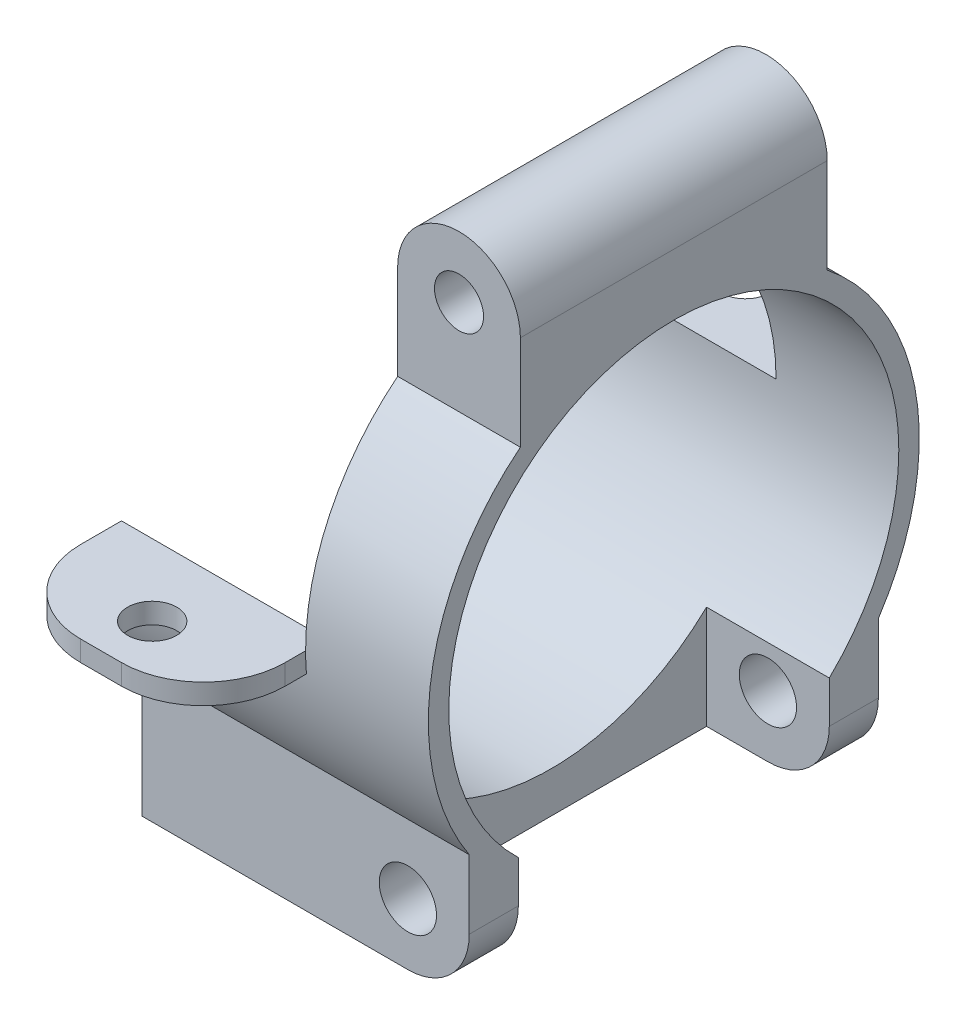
ISO-10303-21;
HEADER;
FILE_DESCRIPTION(('STEP AP214'),'2;1');
FILE_NAME('part.step','',(''),(''),'','','');
FILE_SCHEMA(('AUTOMOTIVE_DESIGN { 1 0 10303 214 1 1 1 1 }'));
ENDSEC;
DATA;
#1=APPLICATION_CONTEXT('core data for automotive mechanical design processes');
#2=APPLICATION_PROTOCOL_DEFINITION('international standard','automotive_design',2000,#1);
#3=PRODUCT_CONTEXT('',#1,'mechanical');
#4=PRODUCT('Part','Part','',(#3));
#5=PRODUCT_RELATED_PRODUCT_CATEGORY('part','',(#4));
#6=PRODUCT_DEFINITION_FORMATION('','',#4);
#7=PRODUCT_DEFINITION_CONTEXT('part definition',#1,'design');
#8=PRODUCT_DEFINITION('design','',#6,#7);
#9=PRODUCT_DEFINITION_SHAPE('','',#8);
#10=(LENGTH_UNIT() NAMED_UNIT(*) SI_UNIT(.MILLI.,.METRE.));
#11=(NAMED_UNIT(*) PLANE_ANGLE_UNIT() SI_UNIT($,.RADIAN.));
#12=(NAMED_UNIT(*) SI_UNIT($,.STERADIAN.) SOLID_ANGLE_UNIT());
#13=UNCERTAINTY_MEASURE_WITH_UNIT(LENGTH_MEASURE(1.E-05),#10,'distance_accuracy_value','');
#14=(GEOMETRIC_REPRESENTATION_CONTEXT(3) GLOBAL_UNCERTAINTY_ASSIGNED_CONTEXT((#13)) GLOBAL_UNIT_ASSIGNED_CONTEXT((#10,
#11,#12)) REPRESENTATION_CONTEXT('',''));
#15=CARTESIAN_POINT('',(0.,0.,0.));
#16=DIRECTION('',(0.,0.,1.));
#17=DIRECTION('',(1.,0.,0.));
#18=AXIS2_PLACEMENT_3D('',#15,#16,#17);
#19=CARTESIAN_POINT('',(0.,0.,9.525));
#20=DIRECTION('',(0.,0.,-1.));
#21=DIRECTION('',(-1.,0.,0.));
#22=AXIS2_PLACEMENT_3D('',#19,#20,#21);
#23=CYLINDRICAL_SURFACE('',#22,3.81);
#24=DIRECTION('',(0.,0.,1.));
#25=VECTOR('',#24,1.);
#26=CARTESIAN_POINT('',(0.,-3.81,-12.7));
#27=LINE('',#26,#25);
#28=CARTESIAN_POINT('',(0.,-3.81,9.652));
#29=VERTEX_POINT('',#28);
#30=CARTESIAN_POINT('',(0.,-3.81,12.7));
#31=VERTEX_POINT('',#30);
#32=EDGE_CURVE('E365',#29,#31,#27,.T.);
#33=ORIENTED_EDGE('',*,*,#32,.F.);
#34=CARTESIAN_POINT('',(0.,0.,9.652));
#35=DIRECTION('',(0.,0.,1.));
#36=DIRECTION('',(1.,0.,0.));
#37=AXIS2_PLACEMENT_3D('',#34,#35,#36);
#38=CIRCLE('',#37,3.81);
#39=CARTESIAN_POINT('',(3.81,0.,9.652));
#40=VERTEX_POINT('',#39);
#41=EDGE_CURVE('E325',#29,#40,#38,.T.);
#42=ORIENTED_EDGE('',*,*,#41,.T.);
#43=DIRECTION('',(0.,0.,-1.));
#44=VECTOR('',#43,1.);
#45=CARTESIAN_POINT('',(3.81,0.,9.525));
#46=LINE('',#45,#44);
#47=CARTESIAN_POINT('',(3.81,0.,12.7));
#48=VERTEX_POINT('',#47);
#49=EDGE_CURVE('E426',#48,#40,#46,.T.);
#50=ORIENTED_EDGE('',*,*,#49,.F.);
#51=CARTESIAN_POINT('',(0.,0.,12.7));
#52=DIRECTION('',(0.,0.,1.));
#53=DIRECTION('',(1.,0.,0.));
#54=AXIS2_PLACEMENT_3D('',#51,#52,#53);
#55=CIRCLE('',#54,3.81);
#56=EDGE_CURVE('E387',#31,#48,#55,.T.);
#57=ORIENTED_EDGE('',*,*,#56,.F.);
#58=EDGE_LOOP('',(#33,#42,#50,#57));
#59=FACE_BOUND('',#58,.T.);
#60=ADVANCED_FACE('F33',(#59),#23,.T.);
#61=CARTESIAN_POINT('',(0.,0.,-15.24));
#62=DIRECTION('',(0.,0.,1.));
#63=DIRECTION('',(1.,0.,0.));
#64=AXIS2_PLACEMENT_3D('',#61,#62,#63);
#65=CYLINDRICAL_SURFACE('',#64,1.778);
#66=CARTESIAN_POINT('',(0.,0.,9.652));
#67=DIRECTION('',(0.,0.,1.));
#68=DIRECTION('',(1.,0.,0.));
#69=AXIS2_PLACEMENT_3D('',#66,#67,#68);
#70=CIRCLE('',#69,1.778);
#71=CARTESIAN_POINT('',(1.778,0.,9.652));
#72=VERTEX_POINT('',#71);
#73=EDGE_CURVE('E321',#72,#72,#70,.F.);
#74=ORIENTED_EDGE('',*,*,#73,.T.);
#75=EDGE_LOOP('',(#74));
#76=FACE_BOUND('',#75,.T.);
#77=CARTESIAN_POINT('',(0.,0.,12.7));
#78=DIRECTION('',(0.,0.,1.));
#79=DIRECTION('',(1.,0.,0.));
#80=AXIS2_PLACEMENT_3D('',#77,#78,#79);
#81=CIRCLE('',#80,1.778);
#82=CARTESIAN_POINT('',(1.778,0.,12.7));
#83=VERTEX_POINT('',#82);
#84=EDGE_CURVE('E334',#83,#83,#81,.T.);
#85=ORIENTED_EDGE('',*,*,#84,.T.);
#86=EDGE_LOOP('',(#85));
#87=FACE_BOUND('',#86,.T.);
#88=ADVANCED_FACE('F543',(#76,#87),#65,.F.);
#89=CARTESIAN_POINT('',(3.81,0.,-9.652));
#90=VERTEX_POINT('',#89);
#91=CARTESIAN_POINT('',(3.81,0.,-12.7));
#92=VERTEX_POINT('',#91);
#93=EDGE_CURVE('E425',#90,#92,#46,.T.);
#94=ORIENTED_EDGE('',*,*,#93,.F.);
#95=CARTESIAN_POINT('',(0.,0.,-9.652));
#96=DIRECTION('',(0.,0.,-1.));
#97=DIRECTION('',(-1.,0.,0.));
#98=AXIS2_PLACEMENT_3D('',#95,#96,#97);
#99=CIRCLE('',#98,3.81);
#100=CARTESIAN_POINT('',(0.,-3.81,-9.652));
#101=VERTEX_POINT('',#100);
#102=EDGE_CURVE('E315',#90,#101,#99,.T.);
#103=ORIENTED_EDGE('',*,*,#102,.T.);
#104=CARTESIAN_POINT('',(0.,-3.81,-12.7));
#105=VERTEX_POINT('',#104);
#106=EDGE_CURVE('E366',#105,#101,#27,.T.);
#107=ORIENTED_EDGE('',*,*,#106,.F.);
#108=CARTESIAN_POINT('',(0.,0.,-12.7));
#109=DIRECTION('',(0.,0.,1.));
#110=DIRECTION('',(1.,0.,0.));
#111=AXIS2_PLACEMENT_3D('',#108,#109,#110);
#112=CIRCLE('',#111,3.81);
#113=EDGE_CURVE('E384',#105,#92,#112,.T.);
#114=ORIENTED_EDGE('',*,*,#113,.T.);
#115=EDGE_LOOP('',(#94,#103,#107,#114));
#116=FACE_BOUND('',#115,.T.);
#117=ADVANCED_FACE('F35',(#116),#23,.T.);
#118=CARTESIAN_POINT('',(-3.81,12.7,0.));
#119=DIRECTION('',(1.,0.,0.));
#120=DIRECTION('',(0.,0.,-1.));
#121=AXIS2_PLACEMENT_3D('',#118,#119,#120);
#122=CYLINDRICAL_SURFACE('',#121,15.24);
#123=CARTESIAN_POINT('',(-3.81,12.7,0.));
#124=DIRECTION('',(1.,0.,0.));
#125=DIRECTION('',(0.,1.,0.));
#126=AXIS2_PLACEMENT_3D('',#123,#124,#125);
#127=CIRCLE('',#126,15.24);
#128=CARTESIAN_POINT('',(-3.81,12.7,-15.24));
#129=VERTEX_POINT('',#128);
#130=CARTESIAN_POINT('',(-3.81,11.43,-15.1869911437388));
#131=VERTEX_POINT('',#130);
#132=EDGE_CURVE('E301',#129,#131,#127,.F.);
#133=ORIENTED_EDGE('',*,*,#132,.F.);
#134=CARTESIAN_POINT('',(-3.81,12.7,0.));
#135=DIRECTION('',(1.,0.,0.));
#136=DIRECTION('',(0.,0.,-1.));
#137=AXIS2_PLACEMENT_3D('',#134,#135,#136);
#138=CIRCLE('',#137,15.24);
#139=CARTESIAN_POINT('',(-3.81,24.5967211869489,-9.525));
#140=VERTEX_POINT('',#139);
#141=EDGE_CURVE('E398',#129,#140,#138,.T.);
#142=ORIENTED_EDGE('',*,*,#141,.T.);
#143=DIRECTION('',(1.,0.,0.));
#144=VECTOR('',#143,1.);
#145=CARTESIAN_POINT('',(-3.81,24.5967211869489,-9.525));
#146=LINE('',#145,#144);
#147=CARTESIAN_POINT('',(3.81,24.5967211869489,-9.525));
#148=VERTEX_POINT('',#147);
#149=EDGE_CURVE('E429',#148,#140,#146,.F.);
#150=ORIENTED_EDGE('',*,*,#149,.F.);
#151=CARTESIAN_POINT('',(3.81,12.7,0.));
#152=DIRECTION('',(1.,0.,0.));
#153=DIRECTION('',(0.,0.,-1.));
#154=AXIS2_PLACEMENT_3D('',#151,#152,#153);
#155=CIRCLE('',#154,15.24);
#156=CARTESIAN_POINT('',(3.81,4.27577303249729,-12.7));
#157=VERTEX_POINT('',#156);
#158=EDGE_CURVE('E393',#157,#148,#155,.T.);
#159=ORIENTED_EDGE('',*,*,#158,.F.);
#160=DIRECTION('',(1.,0.,0.));
#161=VECTOR('',#160,1.);
#162=CARTESIAN_POINT('',(-3.81,4.27577303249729,-12.7));
#163=LINE('',#162,#161);
#164=CARTESIAN_POINT('',(-16.51,4.27577303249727,-12.7));
#165=VERTEX_POINT('',#164);
#166=EDGE_CURVE('E42',#157,#165,#163,.F.);
#167=ORIENTED_EDGE('',*,*,#166,.T.);
#168=CARTESIAN_POINT('',(-16.51,12.7,0.));
#169=DIRECTION('',(-1.,0.,0.));
#170=DIRECTION('',(0.,-1.,0.));
#171=AXIS2_PLACEMENT_3D('',#168,#169,#170);
#172=CIRCLE('',#171,15.24);
#173=CARTESIAN_POINT('',(-16.51,11.43,-15.1869911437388));
#174=VERTEX_POINT('',#173);
#175=EDGE_CURVE('E344',#174,#165,#172,.T.);
#176=ORIENTED_EDGE('',*,*,#175,.F.);
#177=DIRECTION('',(1.,0.,0.));
#178=VECTOR('',#177,1.);
#179=CARTESIAN_POINT('',(-3.81,11.43,-15.1869911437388));
#180=LINE('',#179,#178);
#181=EDGE_CURVE('E292',#174,#131,#180,.T.);
#182=ORIENTED_EDGE('',*,*,#181,.T.);
#183=EDGE_LOOP('',(#133,#142,#150,#159,#167,#176,#182));
#184=FACE_BOUND('',#183,.T.);
#185=ADVANCED_FACE('F489',(#184),#122,.T.);
#186=CARTESIAN_POINT('',(3.81,0.,9.525));
#187=DIRECTION('',(-1.,0.,0.));
#188=DIRECTION('',(0.,0.,1.));
#189=AXIS2_PLACEMENT_3D('',#186,#187,#188);
#190=PLANE('',#189);
#191=ORIENTED_EDGE('',*,*,#49,.T.);
#192=DIRECTION('',(0.,-1.,0.));
#193=VECTOR('',#192,1.);
#194=CARTESIAN_POINT('',(3.81,-5.20623341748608,9.652));
#195=LINE('',#194,#193);
#196=CARTESIAN_POINT('',(3.81,2.6005051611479,9.652));
#197=VERTEX_POINT('',#196);
#198=EDGE_CURVE('E303',#197,#40,#195,.T.);
#199=ORIENTED_EDGE('',*,*,#198,.F.);
#200=CARTESIAN_POINT('',(3.81,12.7,0.));
#201=DIRECTION('',(1.,0.,0.));
#202=DIRECTION('',(0.,0.,-1.));
#203=AXIS2_PLACEMENT_3D('',#200,#201,#202);
#204=CIRCLE('',#203,13.97);
#205=CARTESIAN_POINT('',(3.81,2.60050516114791,-9.652));
#206=VERTEX_POINT('',#205);
#207=EDGE_CURVE('E381',#206,#197,#204,.T.);
#208=ORIENTED_EDGE('',*,*,#207,.F.);
#209=DIRECTION('',(0.,1.,0.));
#210=VECTOR('',#209,1.);
#211=CARTESIAN_POINT('',(3.81,-5.20623341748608,-9.652));
#212=LINE('',#211,#210);
#213=EDGE_CURVE('E307',#90,#206,#212,.T.);
#214=ORIENTED_EDGE('',*,*,#213,.F.);
#215=ORIENTED_EDGE('',*,*,#93,.T.);
#216=DIRECTION('',(0.,1.,0.));
#217=VECTOR('',#216,1.);
#218=CARTESIAN_POINT('',(3.81,0.,-12.7));
#219=LINE('',#218,#217);
#220=EDGE_CURVE('E390',#92,#157,#219,.T.);
#221=ORIENTED_EDGE('',*,*,#220,.T.);
#222=ORIENTED_EDGE('',*,*,#158,.T.);
#223=DIRECTION('',(0.,1.,0.));
#224=VECTOR('',#223,1.);
#225=CARTESIAN_POINT('',(3.81,0.,-9.525));
#226=LINE('',#225,#224);
#227=CARTESIAN_POINT('',(3.81,30.48,-9.525));
#228=VERTEX_POINT('',#227);
#229=EDGE_CURVE('E406',#148,#228,#226,.T.);
#230=ORIENTED_EDGE('',*,*,#229,.T.);
#231=DIRECTION('',(0.,0.,-1.));
#232=VECTOR('',#231,1.);
#233=CARTESIAN_POINT('',(3.81,30.48,9.525));
#234=LINE('',#233,#232);
#235=CARTESIAN_POINT('',(3.81,30.48,9.525));
#236=VERTEX_POINT('',#235);
#237=EDGE_CURVE('E422',#236,#228,#234,.T.);
#238=ORIENTED_EDGE('',*,*,#237,.F.);
#239=DIRECTION('',(0.,1.,0.));
#240=VECTOR('',#239,1.);
#241=CARTESIAN_POINT('',(3.81,0.,9.525));
#242=LINE('',#241,#240);
#243=CARTESIAN_POINT('',(3.81,24.596721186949,9.525));
#244=VERTEX_POINT('',#243);
#245=EDGE_CURVE('E407',#244,#236,#242,.T.);
#246=ORIENTED_EDGE('',*,*,#245,.F.);
#247=CARTESIAN_POINT('',(3.81,4.27577303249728,12.7));
#248=VERTEX_POINT('',#247);
#249=EDGE_CURVE('E401',#244,#248,#155,.T.);
#250=ORIENTED_EDGE('',*,*,#249,.T.);
#251=DIRECTION('',(0.,1.,0.));
#252=VECTOR('',#251,1.);
#253=CARTESIAN_POINT('',(3.81,0.,12.7));
#254=LINE('',#253,#252);
#255=EDGE_CURVE('E389',#48,#248,#254,.T.);
#256=ORIENTED_EDGE('',*,*,#255,.F.);
#257=EDGE_LOOP('',(#191,#199,#208,#214,#215,#221,#222,#230,#238,#246,#250,#256));
#258=FACE_BOUND('',#257,.T.);
#259=ADVANCED_FACE('F510',(#258),#190,.F.);
#260=CARTESIAN_POINT('',(0.,30.48,9.525));
#261=DIRECTION('',(0.,0.,-1.));
#262=DIRECTION('',(-1.,0.,0.));
#263=AXIS2_PLACEMENT_3D('',#260,#261,#262);
#264=CYLINDRICAL_SURFACE('',#263,3.81);
#265=CARTESIAN_POINT('',(0.,30.48,-9.525));
#266=DIRECTION('',(0.,0.,1.));
#267=DIRECTION('',(1.,0.,0.));
#268=AXIS2_PLACEMENT_3D('',#265,#266,#267);
#269=CIRCLE('',#268,3.81);
#270=CARTESIAN_POINT('',(-3.81,30.48,-9.525));
#271=VERTEX_POINT('',#270);
#272=EDGE_CURVE('E416',#228,#271,#269,.T.);
#273=ORIENTED_EDGE('',*,*,#272,.T.);
#274=DIRECTION('',(0.,0.,-1.));
#275=VECTOR('',#274,1.);
#276=CARTESIAN_POINT('',(-3.81,30.48,9.525));
#277=LINE('',#276,#275);
#278=CARTESIAN_POINT('',(-3.81,30.48,9.525));
#279=VERTEX_POINT('',#278);
#280=EDGE_CURVE('E414',#279,#271,#277,.T.);
#281=ORIENTED_EDGE('',*,*,#280,.F.);
#282=CARTESIAN_POINT('',(0.,30.48,9.525));
#283=DIRECTION('',(0.,0.,1.));
#284=DIRECTION('',(1.,0.,0.));
#285=AXIS2_PLACEMENT_3D('',#282,#283,#284);
#286=CIRCLE('',#285,3.81);
#287=EDGE_CURVE('E409',#236,#279,#286,.T.);
#288=ORIENTED_EDGE('',*,*,#287,.F.);
#289=ORIENTED_EDGE('',*,*,#237,.T.);
#290=EDGE_LOOP('',(#273,#281,#288,#289));
#291=FACE_BOUND('',#290,.T.);
#292=ADVANCED_FACE('F596',(#291),#264,.T.);
#293=CARTESIAN_POINT('',(-3.81,0.,9.525));
#294=DIRECTION('',(1.,0.,0.));
#295=DIRECTION('',(0.,1.,0.));
#296=AXIS2_PLACEMENT_3D('',#293,#294,#295);
#297=PLANE('',#296);
#298=ORIENTED_EDGE('',*,*,#141,.F.);
#299=DIRECTION('',(0.,0.,1.));
#300=VECTOR('',#299,1.);
#301=CARTESIAN_POINT('',(-3.81,12.7,9.525));
#302=LINE('',#301,#300);
#303=CARTESIAN_POINT('',(-3.81,12.7,-13.97));
#304=VERTEX_POINT('',#303);
#305=EDGE_CURVE('E379',#129,#304,#302,.T.);
#306=ORIENTED_EDGE('',*,*,#305,.T.);
#307=CARTESIAN_POINT('',(-3.81,12.7,0.));
#308=DIRECTION('',(1.,0.,0.));
#309=DIRECTION('',(0.,0.,-1.));
#310=AXIS2_PLACEMENT_3D('',#307,#308,#309);
#311=CIRCLE('',#310,13.97);
#312=CARTESIAN_POINT('',(-3.81,12.7,13.97));
#313=VERTEX_POINT('',#312);
#314=EDGE_CURVE('E382',#304,#313,#311,.T.);
#315=ORIENTED_EDGE('',*,*,#314,.T.);
#316=DIRECTION('',(0.,0.,1.));
#317=VECTOR('',#316,1.);
#318=CARTESIAN_POINT('',(-3.81,12.7,9.525));
#319=LINE('',#318,#317);
#320=CARTESIAN_POINT('',(-3.81,12.7,15.24));
#321=VERTEX_POINT('',#320);
#322=EDGE_CURVE('E372',#313,#321,#319,.T.);
#323=ORIENTED_EDGE('',*,*,#322,.T.);
#324=CARTESIAN_POINT('',(-3.81,24.5967211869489,9.525));
#325=VERTEX_POINT('',#324);
#326=EDGE_CURVE('E400',#325,#321,#138,.T.);
#327=ORIENTED_EDGE('',*,*,#326,.F.);
#328=DIRECTION('',(0.,-1.,0.));
#329=VECTOR('',#328,1.);
#330=CARTESIAN_POINT('',(-3.81,0.,9.525));
#331=LINE('',#330,#329);
#332=EDGE_CURVE('E412',#279,#325,#331,.T.);
#333=ORIENTED_EDGE('',*,*,#332,.F.);
#334=ORIENTED_EDGE('',*,*,#280,.T.);
#335=DIRECTION('',(0.,-1.,0.));
#336=VECTOR('',#335,1.);
#337=CARTESIAN_POINT('',(-3.81,0.,-9.525));
#338=LINE('',#337,#336);
#339=EDGE_CURVE('E410',#271,#140,#338,.T.);
#340=ORIENTED_EDGE('',*,*,#339,.T.);
#341=EDGE_LOOP('',(#298,#306,#315,#323,#327,#333,#334,#340));
#342=FACE_BOUND('',#341,.T.);
#343=ADVANCED_FACE('F517',(#342),#297,.F.);
#344=CARTESIAN_POINT('',(0.,0.,9.525));
#345=DIRECTION('',(0.,0.,1.));
#346=DIRECTION('',(1.,0.,0.));
#347=AXIS2_PLACEMENT_3D('',#344,#345,#346);
#348=PLANE('',#347);
#349=CARTESIAN_POINT('',(0.,30.48,9.525));
#350=DIRECTION('',(0.,0.,1.));
#351=DIRECTION('',(1.,0.,0.));
#352=AXIS2_PLACEMENT_3D('',#349,#350,#351);
#353=CIRCLE('',#352,1.524);
#354=CARTESIAN_POINT('',(1.524,30.48,9.525));
#355=VERTEX_POINT('',#354);
#356=EDGE_CURVE('E341',#355,#355,#353,.T.);
#357=ORIENTED_EDGE('',*,*,#356,.F.);
#358=EDGE_LOOP('',(#357));
#359=FACE_BOUND('',#358,.T.);
#360=DIRECTION('',(1.,0.,0.));
#361=VECTOR('',#360,1.);
#362=CARTESIAN_POINT('',(-3.81,24.596721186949,9.525));
#363=LINE('',#362,#361);
#364=EDGE_CURVE('E403',#244,#325,#363,.F.);
#365=ORIENTED_EDGE('',*,*,#364,.F.);
#366=ORIENTED_EDGE('',*,*,#245,.T.);
#367=ORIENTED_EDGE('',*,*,#287,.T.);
#368=ORIENTED_EDGE('',*,*,#332,.T.);
#369=EDGE_LOOP('',(#365,#366,#367,#368));
#370=FACE_BOUND('',#369,.T.);
#371=ADVANCED_FACE('F515',(#359,#370),#348,.T.);
#372=CARTESIAN_POINT('',(0.,0.,-9.525));
#373=DIRECTION('',(0.,0.,1.));
#374=DIRECTION('',(1.,0.,0.));
#375=AXIS2_PLACEMENT_3D('',#372,#373,#374);
#376=PLANE('',#375);
#377=CARTESIAN_POINT('',(0.,30.48,-9.525));
#378=DIRECTION('',(0.,0.,1.));
#379=DIRECTION('',(1.,0.,0.));
#380=AXIS2_PLACEMENT_3D('',#377,#378,#379);
#381=CIRCLE('',#380,1.524);
#382=CARTESIAN_POINT('',(1.524,30.48,-9.525));
#383=VERTEX_POINT('',#382);
#384=EDGE_CURVE('E340',#383,#383,#381,.T.);
#385=ORIENTED_EDGE('',*,*,#384,.T.);
#386=EDGE_LOOP('',(#385));
#387=FACE_BOUND('',#386,.T.);
#388=ORIENTED_EDGE('',*,*,#229,.F.);
#389=ORIENTED_EDGE('',*,*,#149,.T.);
#390=ORIENTED_EDGE('',*,*,#339,.F.);
#391=ORIENTED_EDGE('',*,*,#272,.F.);
#392=EDGE_LOOP('',(#388,#389,#390,#391));
#393=FACE_BOUND('',#392,.T.);
#394=ADVANCED_FACE('F524',(#387,#393),#376,.F.);
#395=CARTESIAN_POINT('',(-3.81000000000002,12.7,0.));
#396=DIRECTION('',(1.,0.,0.));
#397=DIRECTION('',(0.,0.,-1.));
#398=AXIS2_PLACEMENT_3D('',#395,#396,#397);
#399=CIRCLE('',#398,15.24);
#400=CARTESIAN_POINT('',(-3.81,11.43,15.1869911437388));
#401=VERTEX_POINT('',#400);
#402=EDGE_CURVE('E50',#401,#321,#399,.F.);
#403=ORIENTED_EDGE('',*,*,#402,.F.);
#404=DIRECTION('',(1.,0.,0.));
#405=VECTOR('',#404,1.);
#406=CARTESIAN_POINT('',(-3.81,11.43,15.1869911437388));
#407=LINE('',#406,#405);
#408=CARTESIAN_POINT('',(-16.51,11.43,15.1869911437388));
#409=VERTEX_POINT('',#408);
#410=EDGE_CURVE('E54',#409,#401,#407,.T.);
#411=ORIENTED_EDGE('',*,*,#410,.F.);
#412=CARTESIAN_POINT('',(-16.51,12.7,0.));
#413=DIRECTION('',(-1.,0.,0.));
#414=DIRECTION('',(0.,-1.,0.));
#415=AXIS2_PLACEMENT_3D('',#412,#413,#414);
#416=CIRCLE('',#415,15.24);
#417=CARTESIAN_POINT('',(-16.51,4.27577303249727,12.7));
#418=VERTEX_POINT('',#417);
#419=EDGE_CURVE('E355',#418,#409,#416,.T.);
#420=ORIENTED_EDGE('',*,*,#419,.F.);
#421=DIRECTION('',(1.,0.,0.));
#422=VECTOR('',#421,1.);
#423=CARTESIAN_POINT('',(-3.81,4.27577303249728,12.7));
#424=LINE('',#423,#422);
#425=EDGE_CURVE('E432',#248,#418,#424,.F.);
#426=ORIENTED_EDGE('',*,*,#425,.F.);
#427=ORIENTED_EDGE('',*,*,#249,.F.);
#428=ORIENTED_EDGE('',*,*,#364,.T.);
#429=ORIENTED_EDGE('',*,*,#326,.T.);
#430=EDGE_LOOP('',(#403,#411,#420,#426,#427,#428,#429));
#431=FACE_BOUND('',#430,.T.);
#432=ADVANCED_FACE('F505',(#431),#122,.T.);
#433=CARTESIAN_POINT('',(0.,0.,12.7));
#434=DIRECTION('',(0.,0.,1.));
#435=DIRECTION('',(1.,0.,0.));
#436=AXIS2_PLACEMENT_3D('',#433,#434,#435);
#437=PLANE('',#436);
#438=ORIENTED_EDGE('',*,*,#84,.F.);
#439=EDGE_LOOP('',(#438));
#440=FACE_BOUND('',#439,.T.);
#441=DIRECTION('',(-1.,0.,0.));
#442=VECTOR('',#441,1.);
#443=CARTESIAN_POINT('',(0.,-3.81,12.7));
#444=LINE('',#443,#442);
#445=CARTESIAN_POINT('',(-16.51,-3.81,12.7));
#446=VERTEX_POINT('',#445);
#447=EDGE_CURVE('E375',#31,#446,#444,.T.);
#448=ORIENTED_EDGE('',*,*,#447,.F.);
#449=ORIENTED_EDGE('',*,*,#56,.T.);
#450=ORIENTED_EDGE('',*,*,#255,.T.);
#451=ORIENTED_EDGE('',*,*,#425,.T.);
#452=DIRECTION('',(0.,1.,0.));
#453=VECTOR('',#452,1.);
#454=CARTESIAN_POINT('',(-16.51,-3.81,12.7));
#455=LINE('',#454,#453);
#456=EDGE_CURVE('E352',#446,#418,#455,.T.);
#457=ORIENTED_EDGE('',*,*,#456,.F.);
#458=EDGE_LOOP('',(#448,#449,#450,#451,#457));
#459=FACE_BOUND('',#458,.T.);
#460=ADVANCED_FACE('F503',(#440,#459),#437,.T.);
#461=CARTESIAN_POINT('',(0.,0.,-12.7));
#462=DIRECTION('',(0.,0.,1.));
#463=DIRECTION('',(1.,0.,0.));
#464=AXIS2_PLACEMENT_3D('',#461,#462,#463);
#465=PLANE('',#464);
#466=CARTESIAN_POINT('',(0.,0.,-12.7));
#467=DIRECTION('',(0.,0.,1.));
#468=DIRECTION('',(1.,0.,0.));
#469=AXIS2_PLACEMENT_3D('',#466,#467,#468);
#470=CIRCLE('',#469,1.778);
#471=CARTESIAN_POINT('',(1.778,0.,-12.7));
#472=VERTEX_POINT('',#471);
#473=EDGE_CURVE('E337',#472,#472,#470,.T.);
#474=ORIENTED_EDGE('',*,*,#473,.T.);
#475=EDGE_LOOP('',(#474));
#476=FACE_BOUND('',#475,.T.);
#477=ORIENTED_EDGE('',*,*,#113,.F.);
#478=DIRECTION('',(-1.,0.,0.));
#479=VECTOR('',#478,1.);
#480=CARTESIAN_POINT('',(0.,-3.81,-12.7));
#481=LINE('',#480,#479);
#482=CARTESIAN_POINT('',(-16.51,-3.81,-12.7));
#483=VERTEX_POINT('',#482);
#484=EDGE_CURVE('E369',#105,#483,#481,.T.);
#485=ORIENTED_EDGE('',*,*,#484,.T.);
#486=DIRECTION('',(0.,-1.,0.));
#487=VECTOR('',#486,1.);
#488=CARTESIAN_POINT('',(-16.51,-3.81,-12.7));
#489=LINE('',#488,#487);
#490=EDGE_CURVE('E346',#165,#483,#489,.T.);
#491=ORIENTED_EDGE('',*,*,#490,.F.);
#492=ORIENTED_EDGE('',*,*,#166,.F.);
#493=ORIENTED_EDGE('',*,*,#220,.F.);
#494=EDGE_LOOP('',(#477,#485,#491,#492,#493));
#495=FACE_BOUND('',#494,.T.);
#496=ADVANCED_FACE('F575',(#476,#495),#465,.F.);
#497=CARTESIAN_POINT('',(-3.81,12.7,0.));
#498=DIRECTION('',(1.,0.,0.));
#499=DIRECTION('',(0.,0.,-1.));
#500=AXIS2_PLACEMENT_3D('',#497,#498,#499);
#501=CYLINDRICAL_SURFACE('',#500,13.97);
#502=ORIENTED_EDGE('',*,*,#207,.T.);
#503=DIRECTION('',(1.,0.,0.));
#504=VECTOR('',#503,1.);
#505=CARTESIAN_POINT('',(-3.81,2.6005051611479,9.652));
#506=LINE('',#505,#504);
#507=CARTESIAN_POINT('',(-3.81,2.6005051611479,9.652));
#508=VERTEX_POINT('',#507);
#509=EDGE_CURVE('E328',#197,#508,#506,.F.);
#510=ORIENTED_EDGE('',*,*,#509,.T.);
#511=CARTESIAN_POINT('',(-3.81,12.7,0.));
#512=DIRECTION('',(-1.,0.,0.));
#513=DIRECTION('',(0.,0.,1.));
#514=AXIS2_PLACEMENT_3D('',#511,#512,#513);
#515=CIRCLE('',#514,13.97);
#516=CARTESIAN_POINT('',(-3.81,2.60050516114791,-9.652));
#517=VERTEX_POINT('',#516);
#518=EDGE_CURVE('E331',#508,#517,#515,.F.);
#519=ORIENTED_EDGE('',*,*,#518,.T.);
#520=DIRECTION('',(1.,0.,0.));
#521=VECTOR('',#520,1.);
#522=CARTESIAN_POINT('',(-3.81,2.60050516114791,-9.652));
#523=LINE('',#522,#521);
#524=EDGE_CURVE('E318',#517,#206,#523,.T.);
#525=ORIENTED_EDGE('',*,*,#524,.T.);
#526=EDGE_LOOP('',(#502,#510,#519,#525));
#527=FACE_BOUND('',#526,.T.);
#528=ORIENTED_EDGE('',*,*,#314,.F.);
#529=DIRECTION('',(-1.,0.,0.));
#530=VECTOR('',#529,1.);
#531=CARTESIAN_POINT('',(0.,12.7,-13.97));
#532=LINE('',#531,#530);
#533=CARTESIAN_POINT('',(-16.51,12.7,-13.97));
#534=VERTEX_POINT('',#533);
#535=EDGE_CURVE('E370',#304,#534,#532,.T.);
#536=ORIENTED_EDGE('',*,*,#535,.T.);
#537=CARTESIAN_POINT('',(-16.51,12.7,0.));
#538=DIRECTION('',(1.,0.,0.));
#539=DIRECTION('',(0.,-1.,0.));
#540=AXIS2_PLACEMENT_3D('',#537,#538,#539);
#541=CIRCLE('',#540,13.97);
#542=CARTESIAN_POINT('',(-16.51,12.7,13.97));
#543=VERTEX_POINT('',#542);
#544=EDGE_CURVE('E360',#543,#534,#541,.T.);
#545=ORIENTED_EDGE('',*,*,#544,.F.);
#546=DIRECTION('',(-1.,0.,0.));
#547=VECTOR('',#546,1.);
#548=CARTESIAN_POINT('',(0.,12.7,13.97));
#549=LINE('',#548,#547);
#550=EDGE_CURVE('E373',#313,#543,#549,.T.);
#551=ORIENTED_EDGE('',*,*,#550,.F.);
#552=EDGE_LOOP('',(#528,#536,#545,#551));
#553=FACE_BOUND('',#552,.T.);
#554=ADVANCED_FACE('F468',(#527,#553),#501,.F.);
#555=CARTESIAN_POINT('',(0.,12.7,-15.24));
#556=DIRECTION('',(0.,1.,0.));
#557=DIRECTION('',(-1.,0.,0.));
#558=AXIS2_PLACEMENT_3D('',#555,#556,#557);
#559=PLANE('',#558);
#560=CARTESIAN_POINT('',(-10.16,12.7,-18.415));
#561=DIRECTION('',(0.,1.,0.));
#562=DIRECTION('',(-1.,0.,0.));
#563=AXIS2_PLACEMENT_3D('',#560,#561,#562);
#564=CIRCLE('',#563,1.524);
#565=CARTESIAN_POINT('',(-11.684,12.7,-18.415));
#566=VERTEX_POINT('',#565);
#567=EDGE_CURVE('E443',#566,#566,#564,.T.);
#568=ORIENTED_EDGE('',*,*,#567,.F.);
#569=EDGE_LOOP('',(#568));
#570=FACE_BOUND('',#569,.T.);
#571=ORIENTED_EDGE('',*,*,#305,.F.);
#572=DIRECTION('',(0.,0.,-1.));
#573=VECTOR('',#572,1.);
#574=CARTESIAN_POINT('',(-3.81,12.7,-13.97));
#575=LINE('',#574,#573);
#576=CARTESIAN_POINT('',(-3.81,12.7,-16.51));
#577=VERTEX_POINT('',#576);
#578=EDGE_CURVE('E263',#129,#577,#575,.T.);
#579=ORIENTED_EDGE('',*,*,#578,.T.);
#580=CARTESIAN_POINT('',(-8.89,12.7,-16.51));
#581=DIRECTION('',(0.,1.,0.));
#582=DIRECTION('',(-1.,0.,0.));
#583=AXIS2_PLACEMENT_3D('',#580,#581,#582);
#584=CIRCLE('',#583,5.08);
#585=CARTESIAN_POINT('',(-8.89,12.7,-21.59));
#586=VERTEX_POINT('',#585);
#587=EDGE_CURVE('E281',#577,#586,#584,.T.);
#588=ORIENTED_EDGE('',*,*,#587,.T.);
#589=DIRECTION('',(-1.,0.,0.));
#590=VECTOR('',#589,1.);
#591=CARTESIAN_POINT('',(-8.89,12.7,-21.59));
#592=LINE('',#591,#590);
#593=CARTESIAN_POINT('',(-11.43,12.7,-21.59));
#594=VERTEX_POINT('',#593);
#595=EDGE_CURVE('E284',#586,#594,#592,.T.);
#596=ORIENTED_EDGE('',*,*,#595,.T.);
#597=CARTESIAN_POINT('',(-11.43,12.7,-16.51));
#598=DIRECTION('',(0.,1.,0.));
#599=DIRECTION('',(-1.,0.,0.));
#600=AXIS2_PLACEMENT_3D('',#597,#598,#599);
#601=CIRCLE('',#600,5.08);
#602=CARTESIAN_POINT('',(-16.51,12.7,-16.51));
#603=VERTEX_POINT('',#602);
#604=EDGE_CURVE('E267',#594,#603,#601,.T.);
#605=ORIENTED_EDGE('',*,*,#604,.T.);
#606=DIRECTION('',(0.,0.,-1.));
#607=VECTOR('',#606,1.);
#608=CARTESIAN_POINT('',(-16.51,12.7,-15.24));
#609=LINE('',#608,#607);
#610=EDGE_CURVE('E363',#534,#603,#609,.T.);
#611=ORIENTED_EDGE('',*,*,#610,.F.);
#612=ORIENTED_EDGE('',*,*,#535,.F.);
#613=EDGE_LOOP('',(#571,#579,#588,#596,#605,#611,#612));
#614=FACE_BOUND('',#613,.T.);
#615=ADVANCED_FACE('F459',(#570,#614),#559,.T.);
#616=CARTESIAN_POINT('',(0.,12.7,13.97));
#617=DIRECTION('',(0.,1.,0.));
#618=DIRECTION('',(-1.,0.,0.));
#619=AXIS2_PLACEMENT_3D('',#616,#617,#618);
#620=PLANE('',#619);
#621=CARTESIAN_POINT('',(-10.16,12.7,18.415));
#622=DIRECTION('',(0.,1.,0.));
#623=DIRECTION('',(1.,0.,0.));
#624=AXIS2_PLACEMENT_3D('',#621,#622,#623);
#625=CIRCLE('',#624,1.524);
#626=CARTESIAN_POINT('',(-8.63599999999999,12.7,18.415));
#627=VERTEX_POINT('',#626);
#628=EDGE_CURVE('E243',#627,#627,#625,.T.);
#629=ORIENTED_EDGE('',*,*,#628,.F.);
#630=EDGE_LOOP('',(#629));
#631=FACE_BOUND('',#630,.T.);
#632=ORIENTED_EDGE('',*,*,#322,.F.);
#633=ORIENTED_EDGE('',*,*,#550,.T.);
#634=DIRECTION('',(0.,0.,-1.));
#635=VECTOR('',#634,1.);
#636=CARTESIAN_POINT('',(-16.51,12.7,13.97));
#637=LINE('',#636,#635);
#638=CARTESIAN_POINT('',(-16.51,12.7,16.51));
#639=VERTEX_POINT('',#638);
#640=EDGE_CURVE('E357',#639,#543,#637,.T.);
#641=ORIENTED_EDGE('',*,*,#640,.F.);
#642=CARTESIAN_POINT('',(-11.43,12.7,16.51));
#643=DIRECTION('',(0.,1.,0.));
#644=DIRECTION('',(1.,0.,0.));
#645=AXIS2_PLACEMENT_3D('',#642,#643,#644);
#646=CIRCLE('',#645,5.08);
#647=CARTESIAN_POINT('',(-11.43,12.7,21.59));
#648=VERTEX_POINT('',#647);
#649=EDGE_CURVE('E240',#639,#648,#646,.T.);
#650=ORIENTED_EDGE('',*,*,#649,.T.);
#651=DIRECTION('',(1.,0.,0.));
#652=VECTOR('',#651,1.);
#653=CARTESIAN_POINT('',(-8.89,12.7,21.59));
#654=LINE('',#653,#652);
#655=CARTESIAN_POINT('',(-8.89,12.7,21.59));
#656=VERTEX_POINT('',#655);
#657=EDGE_CURVE('E237',#648,#656,#654,.T.);
#658=ORIENTED_EDGE('',*,*,#657,.T.);
#659=CARTESIAN_POINT('',(-8.89,12.7,16.51));
#660=DIRECTION('',(0.,1.,0.));
#661=DIRECTION('',(1.,0.,0.));
#662=AXIS2_PLACEMENT_3D('',#659,#660,#661);
#663=CIRCLE('',#662,5.08);
#664=CARTESIAN_POINT('',(-3.81,12.7,16.51));
#665=VERTEX_POINT('',#664);
#666=EDGE_CURVE('E251',#656,#665,#663,.T.);
#667=ORIENTED_EDGE('',*,*,#666,.T.);
#668=DIRECTION('',(0.,0.,-1.));
#669=VECTOR('',#668,1.);
#670=CARTESIAN_POINT('',(-3.81,12.7,13.97));
#671=LINE('',#670,#669);
#672=EDGE_CURVE('E218',#665,#321,#671,.T.);
#673=ORIENTED_EDGE('',*,*,#672,.T.);
#674=EDGE_LOOP('',(#632,#633,#641,#650,#658,#667,#673));
#675=FACE_BOUND('',#674,.T.);
#676=ADVANCED_FACE('F455',(#631,#675),#620,.T.);
#677=CARTESIAN_POINT('',(0.,-3.81,-12.7));
#678=DIRECTION('',(0.,-1.,0.));
#679=DIRECTION('',(1.,0.,0.));
#680=AXIS2_PLACEMENT_3D('',#677,#678,#679);
#681=PLANE('',#680);
#682=DIRECTION('',(-1.,0.,0.));
#683=VECTOR('',#682,1.);
#684=CARTESIAN_POINT('',(0.,-3.81,9.652));
#685=LINE('',#684,#683);
#686=CARTESIAN_POINT('',(-3.81,-3.81,9.652));
#687=VERTEX_POINT('',#686);
#688=EDGE_CURVE('E322',#29,#687,#685,.T.);
#689=ORIENTED_EDGE('',*,*,#688,.F.);
#690=ORIENTED_EDGE('',*,*,#32,.T.);
#691=ORIENTED_EDGE('',*,*,#447,.T.);
#692=DIRECTION('',(0.,0.,1.));
#693=VECTOR('',#692,1.);
#694=CARTESIAN_POINT('',(-16.51,-3.81,-12.7));
#695=LINE('',#694,#693);
#696=EDGE_CURVE('E349',#483,#446,#695,.T.);
#697=ORIENTED_EDGE('',*,*,#696,.F.);
#698=ORIENTED_EDGE('',*,*,#484,.F.);
#699=ORIENTED_EDGE('',*,*,#106,.T.);
#700=DIRECTION('',(1.,0.,0.));
#701=VECTOR('',#700,1.);
#702=CARTESIAN_POINT('',(0.,-3.81,-9.652));
#703=LINE('',#702,#701);
#704=CARTESIAN_POINT('',(-3.81,-3.81,-9.652));
#705=VERTEX_POINT('',#704);
#706=EDGE_CURVE('E313',#705,#101,#703,.T.);
#707=ORIENTED_EDGE('',*,*,#706,.F.);
#708=DIRECTION('',(0.,0.,-1.));
#709=VECTOR('',#708,1.);
#710=CARTESIAN_POINT('',(-3.81,-3.81,-12.7));
#711=LINE('',#710,#709);
#712=EDGE_CURVE('E11',#687,#705,#711,.T.);
#713=ORIENTED_EDGE('',*,*,#712,.F.);
#714=EDGE_LOOP('',(#689,#690,#691,#697,#698,#699,#707,#713));
#715=FACE_BOUND('',#714,.T.);
#716=ADVANCED_FACE('F458',(#715),#681,.T.);
#717=CARTESIAN_POINT('',(-16.51,12.7,0.));
#718=DIRECTION('',(-1.,0.,0.));
#719=DIRECTION('',(0.,-1.,0.));
#720=AXIS2_PLACEMENT_3D('',#717,#718,#719);
#721=PLANE('',#720);
#722=ORIENTED_EDGE('',*,*,#640,.T.);
#723=ORIENTED_EDGE('',*,*,#544,.T.);
#724=ORIENTED_EDGE('',*,*,#610,.T.);
#725=DIRECTION('',(0.,1.,0.));
#726=VECTOR('',#725,1.);
#727=CARTESIAN_POINT('',(-16.51,11.43,-16.51));
#728=LINE('',#727,#726);
#729=CARTESIAN_POINT('',(-16.51,11.43,-16.51));
#730=VERTEX_POINT('',#729);
#731=EDGE_CURVE('E289',#730,#603,#728,.T.);
#732=ORIENTED_EDGE('',*,*,#731,.F.);
#733=DIRECTION('',(0.,0.,1.));
#734=VECTOR('',#733,1.);
#735=CARTESIAN_POINT('',(-16.51,11.43,-13.97));
#736=LINE('',#735,#734);
#737=EDGE_CURVE('E276',#730,#174,#736,.T.);
#738=ORIENTED_EDGE('',*,*,#737,.T.);
#739=ORIENTED_EDGE('',*,*,#175,.T.);
#740=ORIENTED_EDGE('',*,*,#490,.T.);
#741=ORIENTED_EDGE('',*,*,#696,.T.);
#742=ORIENTED_EDGE('',*,*,#456,.T.);
#743=ORIENTED_EDGE('',*,*,#419,.T.);
#744=DIRECTION('',(0.,0.,1.));
#745=VECTOR('',#744,1.);
#746=CARTESIAN_POINT('',(-16.51,11.43,13.97));
#747=LINE('',#746,#745);
#748=CARTESIAN_POINT('',(-16.51,11.43,16.51));
#749=VERTEX_POINT('',#748);
#750=EDGE_CURVE('E233',#409,#749,#747,.T.);
#751=ORIENTED_EDGE('',*,*,#750,.T.);
#752=DIRECTION('',(0.,1.,0.));
#753=VECTOR('',#752,1.);
#754=CARTESIAN_POINT('',(-16.51,11.43,16.51));
#755=LINE('',#754,#753);
#756=EDGE_CURVE('E223',#749,#639,#755,.T.);
#757=ORIENTED_EDGE('',*,*,#756,.T.);
#758=EDGE_LOOP('',(#722,#723,#724,#732,#738,#739,#740,#741,#742,#743,#751,#757));
#759=FACE_BOUND('',#758,.T.);
#760=ADVANCED_FACE('F472',(#759),#721,.T.);
#761=CARTESIAN_POINT('',(0.,0.,-9.652));
#762=DIRECTION('',(0.,0.,-1.));
#763=DIRECTION('',(-1.,0.,0.));
#764=AXIS2_PLACEMENT_3D('',#761,#762,#763);
#765=CIRCLE('',#764,1.778);
#766=CARTESIAN_POINT('',(-1.778,0.,-9.652));
#767=VERTEX_POINT('',#766);
#768=EDGE_CURVE('E310',#767,#767,#765,.F.);
#769=ORIENTED_EDGE('',*,*,#768,.T.);
#770=EDGE_LOOP('',(#769));
#771=FACE_BOUND('',#770,.T.);
#772=ORIENTED_EDGE('',*,*,#473,.F.);
#773=EDGE_LOOP('',(#772));
#774=FACE_BOUND('',#773,.T.);
#775=ADVANCED_FACE('F550',(#771,#774),#65,.F.);
#776=CARTESIAN_POINT('',(0.,30.48,-15.24));
#777=DIRECTION('',(0.,0.,1.));
#778=DIRECTION('',(1.,0.,0.));
#779=AXIS2_PLACEMENT_3D('',#776,#777,#778);
#780=CYLINDRICAL_SURFACE('',#779,1.524);
#781=ORIENTED_EDGE('',*,*,#356,.T.);
#782=EDGE_LOOP('',(#781));
#783=FACE_BOUND('',#782,.T.);
#784=ORIENTED_EDGE('',*,*,#384,.F.);
#785=EDGE_LOOP('',(#784));
#786=FACE_BOUND('',#785,.T.);
#787=ADVANCED_FACE('F647',(#783,#786),#780,.F.);
#788=CARTESIAN_POINT('',(-3.81,0.,0.));
#789=DIRECTION('',(-1.,0.,0.));
#790=DIRECTION('',(0.,0.,1.));
#791=AXIS2_PLACEMENT_3D('',#788,#789,#790);
#792=PLANE('',#791);
#793=DIRECTION('',(0.,-1.,0.));
#794=VECTOR('',#793,1.);
#795=CARTESIAN_POINT('',(-3.81,-5.20623341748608,9.652));
#796=LINE('',#795,#794);
#797=EDGE_CURVE('E304',#508,#687,#796,.T.);
#798=ORIENTED_EDGE('',*,*,#797,.T.);
#799=ORIENTED_EDGE('',*,*,#712,.T.);
#800=DIRECTION('',(0.,1.,0.));
#801=VECTOR('',#800,1.);
#802=CARTESIAN_POINT('',(-3.81,-5.20623341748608,-9.652));
#803=LINE('',#802,#801);
#804=EDGE_CURVE('E306',#705,#517,#803,.T.);
#805=ORIENTED_EDGE('',*,*,#804,.T.);
#806=ORIENTED_EDGE('',*,*,#518,.F.);
#807=EDGE_LOOP('',(#798,#799,#805,#806));
#808=FACE_BOUND('',#807,.T.);
#809=ADVANCED_FACE('F570',(#808),#792,.F.);
#810=CARTESIAN_POINT('',(-3.81,-5.20623341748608,9.652));
#811=DIRECTION('',(0.,0.,1.));
#812=DIRECTION('',(1.,0.,0.));
#813=AXIS2_PLACEMENT_3D('',#810,#811,#812);
#814=PLANE('',#813);
#815=ORIENTED_EDGE('',*,*,#73,.F.);
#816=EDGE_LOOP('',(#815));
#817=FACE_BOUND('',#816,.T.);
#818=ORIENTED_EDGE('',*,*,#198,.T.);
#819=ORIENTED_EDGE('',*,*,#41,.F.);
#820=ORIENTED_EDGE('',*,*,#688,.T.);
#821=ORIENTED_EDGE('',*,*,#797,.F.);
#822=ORIENTED_EDGE('',*,*,#509,.F.);
#823=EDGE_LOOP('',(#818,#819,#820,#821,#822));
#824=FACE_BOUND('',#823,.T.);
#825=ADVANCED_FACE('F572',(#817,#824),#814,.F.);
#826=CARTESIAN_POINT('',(-3.81,-5.20623341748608,-9.652));
#827=DIRECTION('',(0.,0.,-1.));
#828=DIRECTION('',(-1.,0.,0.));
#829=AXIS2_PLACEMENT_3D('',#826,#827,#828);
#830=PLANE('',#829);
#831=ORIENTED_EDGE('',*,*,#768,.F.);
#832=EDGE_LOOP('',(#831));
#833=FACE_BOUND('',#832,.T.);
#834=ORIENTED_EDGE('',*,*,#804,.F.);
#835=ORIENTED_EDGE('',*,*,#706,.T.);
#836=ORIENTED_EDGE('',*,*,#102,.F.);
#837=ORIENTED_EDGE('',*,*,#213,.T.);
#838=ORIENTED_EDGE('',*,*,#524,.F.);
#839=EDGE_LOOP('',(#834,#835,#836,#837,#838));
#840=FACE_BOUND('',#839,.T.);
#841=ADVANCED_FACE('F566',(#833,#840),#830,.F.);
#842=CARTESIAN_POINT('',(-3.81,11.43,-13.97));
#843=DIRECTION('',(1.,0.,0.));
#844=DIRECTION('',(0.,1.,0.));
#845=AXIS2_PLACEMENT_3D('',#842,#843,#844);
#846=PLANE('',#845);
#847=ORIENTED_EDGE('',*,*,#578,.F.);
#848=ORIENTED_EDGE('',*,*,#132,.T.);
#849=DIRECTION('',(0.,0.,-1.));
#850=VECTOR('',#849,1.);
#851=CARTESIAN_POINT('',(-3.81,11.43,-13.97));
#852=LINE('',#851,#850);
#853=CARTESIAN_POINT('',(-3.81,11.43,-16.51));
#854=VERTEX_POINT('',#853);
#855=EDGE_CURVE('E264',#131,#854,#852,.T.);
#856=ORIENTED_EDGE('',*,*,#855,.T.);
#857=DIRECTION('',(0.,1.,0.));
#858=VECTOR('',#857,1.);
#859=CARTESIAN_POINT('',(-3.81,11.43,-16.51));
#860=LINE('',#859,#858);
#861=EDGE_CURVE('E279',#854,#577,#860,.T.);
#862=ORIENTED_EDGE('',*,*,#861,.T.);
#863=EDGE_LOOP('',(#847,#848,#856,#862));
#864=FACE_BOUND('',#863,.T.);
#865=ADVANCED_FACE('F529',(#864),#846,.T.);
#866=CARTESIAN_POINT('',(-11.43,11.43,-16.51));
#867=DIRECTION('',(0.,1.,0.));
#868=DIRECTION('',(-1.,0.,0.));
#869=AXIS2_PLACEMENT_3D('',#866,#867,#868);
#870=CYLINDRICAL_SURFACE('',#869,5.08);
#871=ORIENTED_EDGE('',*,*,#604,.F.);
#872=DIRECTION('',(0.,1.,0.));
#873=VECTOR('',#872,1.);
#874=CARTESIAN_POINT('',(-11.43,11.43,-21.59));
#875=LINE('',#874,#873);
#876=CARTESIAN_POINT('',(-11.43,11.43,-21.59));
#877=VERTEX_POINT('',#876);
#878=EDGE_CURVE('E293',#877,#594,#875,.T.);
#879=ORIENTED_EDGE('',*,*,#878,.F.);
#880=CARTESIAN_POINT('',(-11.43,11.43,-16.51));
#881=DIRECTION('',(0.,1.,0.));
#882=DIRECTION('',(-1.,0.,0.));
#883=AXIS2_PLACEMENT_3D('',#880,#881,#882);
#884=CIRCLE('',#883,5.08);
#885=EDGE_CURVE('E273',#877,#730,#884,.T.);
#886=ORIENTED_EDGE('',*,*,#885,.T.);
#887=ORIENTED_EDGE('',*,*,#731,.T.);
#888=EDGE_LOOP('',(#871,#879,#886,#887));
#889=FACE_BOUND('',#888,.T.);
#890=ADVANCED_FACE('F478',(#889),#870,.T.);
#891=CARTESIAN_POINT('',(-8.89,11.43,-21.59));
#892=DIRECTION('',(0.,0.,-1.));
#893=DIRECTION('',(-1.,0.,0.));
#894=AXIS2_PLACEMENT_3D('',#891,#892,#893);
#895=PLANE('',#894);
#896=ORIENTED_EDGE('',*,*,#595,.F.);
#897=DIRECTION('',(0.,1.,0.));
#898=VECTOR('',#897,1.);
#899=CARTESIAN_POINT('',(-8.89,11.43,-21.59));
#900=LINE('',#899,#898);
#901=CARTESIAN_POINT('',(-8.89,11.43,-21.59));
#902=VERTEX_POINT('',#901);
#903=EDGE_CURVE('E295',#902,#586,#900,.T.);
#904=ORIENTED_EDGE('',*,*,#903,.F.);
#905=DIRECTION('',(-1.,0.,0.));
#906=VECTOR('',#905,1.);
#907=CARTESIAN_POINT('',(-8.89,11.43,-21.59));
#908=LINE('',#907,#906);
#909=EDGE_CURVE('E270',#902,#877,#908,.T.);
#910=ORIENTED_EDGE('',*,*,#909,.T.);
#911=ORIENTED_EDGE('',*,*,#878,.T.);
#912=EDGE_LOOP('',(#896,#904,#910,#911));
#913=FACE_BOUND('',#912,.T.);
#914=ADVANCED_FACE('F533',(#913),#895,.T.);
#915=CARTESIAN_POINT('',(-8.89,11.43,-16.51));
#916=DIRECTION('',(0.,1.,0.));
#917=DIRECTION('',(-1.,0.,0.));
#918=AXIS2_PLACEMENT_3D('',#915,#916,#917);
#919=CYLINDRICAL_SURFACE('',#918,5.08);
#920=ORIENTED_EDGE('',*,*,#587,.F.);
#921=ORIENTED_EDGE('',*,*,#861,.F.);
#922=CARTESIAN_POINT('',(-8.89,11.43,-16.51));
#923=DIRECTION('',(0.,1.,0.));
#924=DIRECTION('',(-1.,0.,0.));
#925=AXIS2_PLACEMENT_3D('',#922,#923,#924);
#926=CIRCLE('',#925,5.08);
#927=EDGE_CURVE('E266',#854,#902,#926,.T.);
#928=ORIENTED_EDGE('',*,*,#927,.T.);
#929=ORIENTED_EDGE('',*,*,#903,.T.);
#930=EDGE_LOOP('',(#920,#921,#928,#929));
#931=FACE_BOUND('',#930,.T.);
#932=ADVANCED_FACE('F531',(#931),#919,.T.);
#933=CARTESIAN_POINT('',(-8.89,11.43,-16.51));
#934=DIRECTION('',(0.,1.,0.));
#935=DIRECTION('',(-1.,0.,0.));
#936=AXIS2_PLACEMENT_3D('',#933,#934,#935);
#937=PLANE('',#936);
#938=CARTESIAN_POINT('',(-10.16,11.43,-18.415));
#939=DIRECTION('',(0.,1.,0.));
#940=DIRECTION('',(-1.,0.,0.));
#941=AXIS2_PLACEMENT_3D('',#938,#939,#940);
#942=CIRCLE('',#941,1.524);
#943=CARTESIAN_POINT('',(-11.684,11.43,-18.415));
#944=VERTEX_POINT('',#943);
#945=EDGE_CURVE('E37',#944,#944,#942,.T.);
#946=ORIENTED_EDGE('',*,*,#945,.T.);
#947=EDGE_LOOP('',(#946));
#948=FACE_BOUND('',#947,.T.);
#949=ORIENTED_EDGE('',*,*,#181,.F.);
#950=ORIENTED_EDGE('',*,*,#737,.F.);
#951=ORIENTED_EDGE('',*,*,#885,.F.);
#952=ORIENTED_EDGE('',*,*,#909,.F.);
#953=ORIENTED_EDGE('',*,*,#927,.F.);
#954=ORIENTED_EDGE('',*,*,#855,.F.);
#955=EDGE_LOOP('',(#949,#950,#951,#952,#953,#954));
#956=FACE_BOUND('',#955,.T.);
#957=ADVANCED_FACE('F483',(#948,#956),#937,.F.);
#958=CARTESIAN_POINT('',(-8.89,11.43,16.51));
#959=DIRECTION('',(0.,1.,0.));
#960=DIRECTION('',(-1.,0.,0.));
#961=AXIS2_PLACEMENT_3D('',#958,#959,#960);
#962=CYLINDRICAL_SURFACE('',#961,5.08);
#963=ORIENTED_EDGE('',*,*,#666,.F.);
#964=DIRECTION('',(0.,1.,0.));
#965=VECTOR('',#964,1.);
#966=CARTESIAN_POINT('',(-8.89,11.43,21.59));
#967=LINE('',#966,#965);
#968=CARTESIAN_POINT('',(-8.89,11.43,21.59));
#969=VERTEX_POINT('',#968);
#970=EDGE_CURVE('E236',#969,#656,#967,.T.);
#971=ORIENTED_EDGE('',*,*,#970,.F.);
#972=CARTESIAN_POINT('',(-8.89,11.43,16.51));
#973=DIRECTION('',(0.,1.,0.));
#974=DIRECTION('',(1.,0.,0.));
#975=AXIS2_PLACEMENT_3D('',#972,#973,#974);
#976=CIRCLE('',#975,5.08);
#977=CARTESIAN_POINT('',(-3.81,11.43,16.51));
#978=VERTEX_POINT('',#977);
#979=EDGE_CURVE('E231',#969,#978,#976,.T.);
#980=ORIENTED_EDGE('',*,*,#979,.T.);
#981=DIRECTION('',(0.,1.,0.));
#982=VECTOR('',#981,1.);
#983=CARTESIAN_POINT('',(-3.81,11.43,16.51));
#984=LINE('',#983,#982);
#985=EDGE_CURVE('E213',#978,#665,#984,.T.);
#986=ORIENTED_EDGE('',*,*,#985,.T.);
#987=EDGE_LOOP('',(#963,#971,#980,#986));
#988=FACE_BOUND('',#987,.T.);
#989=ADVANCED_FACE('F235',(#988),#962,.T.);
#990=CARTESIAN_POINT('',(-8.89,11.43,21.59));
#991=DIRECTION('',(0.,0.,1.));
#992=DIRECTION('',(1.,0.,0.));
#993=AXIS2_PLACEMENT_3D('',#990,#991,#992);
#994=PLANE('',#993);
#995=ORIENTED_EDGE('',*,*,#657,.F.);
#996=DIRECTION('',(0.,1.,0.));
#997=VECTOR('',#996,1.);
#998=CARTESIAN_POINT('',(-11.43,11.43,21.59));
#999=LINE('',#998,#997);
#1000=CARTESIAN_POINT('',(-11.43,11.43,21.59));
#1001=VERTEX_POINT('',#1000);
#1002=EDGE_CURVE('E257',#1001,#648,#999,.T.);
#1003=ORIENTED_EDGE('',*,*,#1002,.F.);
#1004=DIRECTION('',(1.,0.,0.));
#1005=VECTOR('',#1004,1.);
#1006=CARTESIAN_POINT('',(-8.89,11.43,21.59));
#1007=LINE('',#1006,#1005);
#1008=EDGE_CURVE('E224',#1001,#969,#1007,.T.);
#1009=ORIENTED_EDGE('',*,*,#1008,.T.);
#1010=ORIENTED_EDGE('',*,*,#970,.T.);
#1011=EDGE_LOOP('',(#995,#1003,#1009,#1010));
#1012=FACE_BOUND('',#1011,.T.);
#1013=ADVANCED_FACE('F815',(#1012),#994,.T.);
#1014=CARTESIAN_POINT('',(-11.43,11.43,16.51));
#1015=DIRECTION('',(0.,1.,0.));
#1016=DIRECTION('',(-1.,0.,0.));
#1017=AXIS2_PLACEMENT_3D('',#1014,#1015,#1016);
#1018=CYLINDRICAL_SURFACE('',#1017,5.08);
#1019=ORIENTED_EDGE('',*,*,#649,.F.);
#1020=ORIENTED_EDGE('',*,*,#756,.F.);
#1021=CARTESIAN_POINT('',(-11.43,11.43,16.51));
#1022=DIRECTION('',(0.,1.,0.));
#1023=DIRECTION('',(1.,0.,0.));
#1024=AXIS2_PLACEMENT_3D('',#1021,#1022,#1023);
#1025=CIRCLE('',#1024,5.08);
#1026=EDGE_CURVE('E247',#749,#1001,#1025,.T.);
#1027=ORIENTED_EDGE('',*,*,#1026,.T.);
#1028=ORIENTED_EDGE('',*,*,#1002,.T.);
#1029=EDGE_LOOP('',(#1019,#1020,#1027,#1028));
#1030=FACE_BOUND('',#1029,.T.);
#1031=ADVANCED_FACE('F824',(#1030),#1018,.T.);
#1032=CARTESIAN_POINT('',(-3.81,11.43,13.97));
#1033=DIRECTION('',(1.,0.,0.));
#1034=DIRECTION('',(0.,0.,-1.));
#1035=AXIS2_PLACEMENT_3D('',#1032,#1033,#1034);
#1036=PLANE('',#1035);
#1037=DIRECTION('',(0.,0.,-1.));
#1038=VECTOR('',#1037,1.);
#1039=CARTESIAN_POINT('',(-3.81,11.43,13.97));
#1040=LINE('',#1039,#1038);
#1041=EDGE_CURVE('E216',#978,#401,#1040,.T.);
#1042=ORIENTED_EDGE('',*,*,#1041,.T.);
#1043=ORIENTED_EDGE('',*,*,#402,.T.);
#1044=ORIENTED_EDGE('',*,*,#672,.F.);
#1045=ORIENTED_EDGE('',*,*,#985,.F.);
#1046=EDGE_LOOP('',(#1042,#1043,#1044,#1045));
#1047=FACE_BOUND('',#1046,.T.);
#1048=ADVANCED_FACE('F215',(#1047),#1036,.T.);
#1049=CARTESIAN_POINT('',(-8.89,11.43,16.51));
#1050=DIRECTION('',(0.,-1.,0.));
#1051=DIRECTION('',(1.,0.,0.));
#1052=AXIS2_PLACEMENT_3D('',#1049,#1050,#1051);
#1053=PLANE('',#1052);
#1054=CARTESIAN_POINT('',(-10.16,11.43,18.415));
#1055=DIRECTION('',(0.,-1.,0.));
#1056=DIRECTION('',(1.,0.,0.));
#1057=AXIS2_PLACEMENT_3D('',#1054,#1055,#1056);
#1058=CIRCLE('',#1057,1.524);
#1059=CARTESIAN_POINT('',(-8.63599999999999,11.43,18.415));
#1060=VERTEX_POINT('',#1059);
#1061=EDGE_CURVE('E441',#1060,#1060,#1058,.T.);
#1062=ORIENTED_EDGE('',*,*,#1061,.F.);
#1063=EDGE_LOOP('',(#1062));
#1064=FACE_BOUND('',#1063,.T.);
#1065=ORIENTED_EDGE('',*,*,#750,.F.);
#1066=ORIENTED_EDGE('',*,*,#410,.T.);
#1067=ORIENTED_EDGE('',*,*,#1041,.F.);
#1068=ORIENTED_EDGE('',*,*,#979,.F.);
#1069=ORIENTED_EDGE('',*,*,#1008,.F.);
#1070=ORIENTED_EDGE('',*,*,#1026,.F.);
#1071=EDGE_LOOP('',(#1065,#1066,#1067,#1068,#1069,#1070));
#1072=FACE_BOUND('',#1071,.T.);
#1073=ADVANCED_FACE('F229',(#1064,#1072),#1053,.T.);
#1074=CARTESIAN_POINT('',(-10.16,-3.81,18.415));
#1075=DIRECTION('',(0.,1.,0.));
#1076=DIRECTION('',(-1.,0.,0.));
#1077=AXIS2_PLACEMENT_3D('',#1074,#1075,#1076);
#1078=CYLINDRICAL_SURFACE('',#1077,1.524);
#1079=ORIENTED_EDGE('',*,*,#1061,.T.);
#1080=EDGE_LOOP('',(#1079));
#1081=FACE_BOUND('',#1080,.T.);
#1082=ORIENTED_EDGE('',*,*,#628,.T.);
#1083=EDGE_LOOP('',(#1082));
#1084=FACE_BOUND('',#1083,.T.);
#1085=ADVANCED_FACE('F453',(#1081,#1084),#1078,.F.);
#1086=CARTESIAN_POINT('',(-10.16,-3.81,-18.415));
#1087=DIRECTION('',(0.,1.,0.));
#1088=DIRECTION('',(-1.,0.,0.));
#1089=AXIS2_PLACEMENT_3D('',#1086,#1087,#1088);
#1090=CYLINDRICAL_SURFACE('',#1089,1.524);
#1091=ORIENTED_EDGE('',*,*,#567,.T.);
#1092=EDGE_LOOP('',(#1091));
#1093=FACE_BOUND('',#1092,.T.);
#1094=ORIENTED_EDGE('',*,*,#945,.F.);
#1095=EDGE_LOOP('',(#1094));
#1096=FACE_BOUND('',#1095,.T.);
#1097=ADVANCED_FACE('F856',(#1093,#1096),#1090,.F.);
#1098=CLOSED_SHELL('',(#60,#88,#117,#185,#259,#292,#343,#371,#394,#432,#460,#496,#554,#615,#676,
#716,#760,#775,#787,#809,#825,#841,#865,#890,#914,#932,#957,#989,#1013,#1031,#1048,#1073,#1085,#1097));
#1099=MANIFOLD_SOLID_BREP('B2',#1098);
#1100=ADVANCED_BREP_SHAPE_REPRESENTATION('',(#18,#1099),#14);
#1101=SHAPE_DEFINITION_REPRESENTATION(#9,#1100);
ENDSEC;
END-ISO-10303-21;
